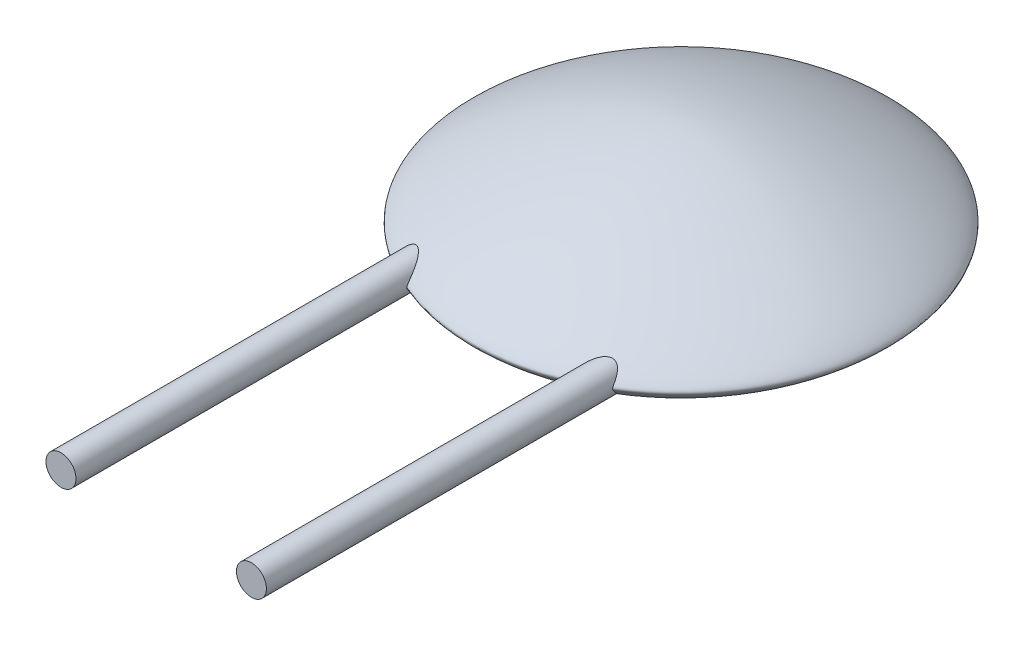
from build123d import *

# Parameters (mm, degrees)
EXTRUSION1_REACH   = 8.526
ESQUISSE2_R        = 0.2
BOSS_EXTRU_1_START = 4
ESQUISSE3_R        = 0.2
BOSS_EXTRU_1_DEPTH = 4


with BuildPart() as part:
    # Esquisse1 → R_volution1 (revolve)
    with BuildSketch(Plane.XY):
        with BuildLine():
            Line((0, 1.05), (0, -1.05))
            add(Edge.make_bspline(
                [(0, 1.05), (-1.172484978, 1.05), (-2.8, 0.16193283), (-2.8, -0.16193283), (-1.295667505, -1.05), (0, -1.05)],
                knots=[0, 0, 0, 0, 0.5, 0.5, 1, 1, 1, 1], degree=3))
        make_face()
    revolve(axis=Axis((0, 1.05, 0), (0, -1, 0)))

    # Esquisse2 → Extrusion1 (add, up to next)
    with BuildSketch(Plane.XY.offset(3), mode=Mode.PRIVATE) as extrusion1_sk1:
        with Locations((-1.27, 0)):
            Circle(ESQUISSE2_R)
    extrusion1_tool1 = extrude(extrusion1_sk1.sketch, amount=-EXTRUSION1_REACH, mode=Mode.PRIVATE) - part.part
    # Esquisse2 → Extrusion1 (add, up to next)
    with BuildSketch(Plane.XY.offset(3), mode=Mode.PRIVATE) as extrusion1_sk2:
        with Locations((1.27, 0)):
            Circle(ESQUISSE2_R)
    extrusion1_tool2 = extrude(extrusion1_sk2.sketch, amount=-EXTRUSION1_REACH, mode=Mode.PRIVATE) - part.part
    add(extrusion1_tool1.solids().sort_by_distance((-1.27, 0, 3))[0])
    add(extrusion1_tool2.solids().sort_by_distance((1.27, 0, 3))[0])

    # Esquisse3 → Boss.-Extru.1 (add)
    with BuildSketch(Plane.XY.offset(3).offset(BOSS_EXTRU_1_START)):
        with Locations((-1.27, 0)):
            Circle(ESQUISSE3_R)
        with Locations((1.27, 0)):
            Circle(ESQUISSE3_R)
    extrude(amount=-BOSS_EXTRU_1_DEPTH)


solid = part.part
